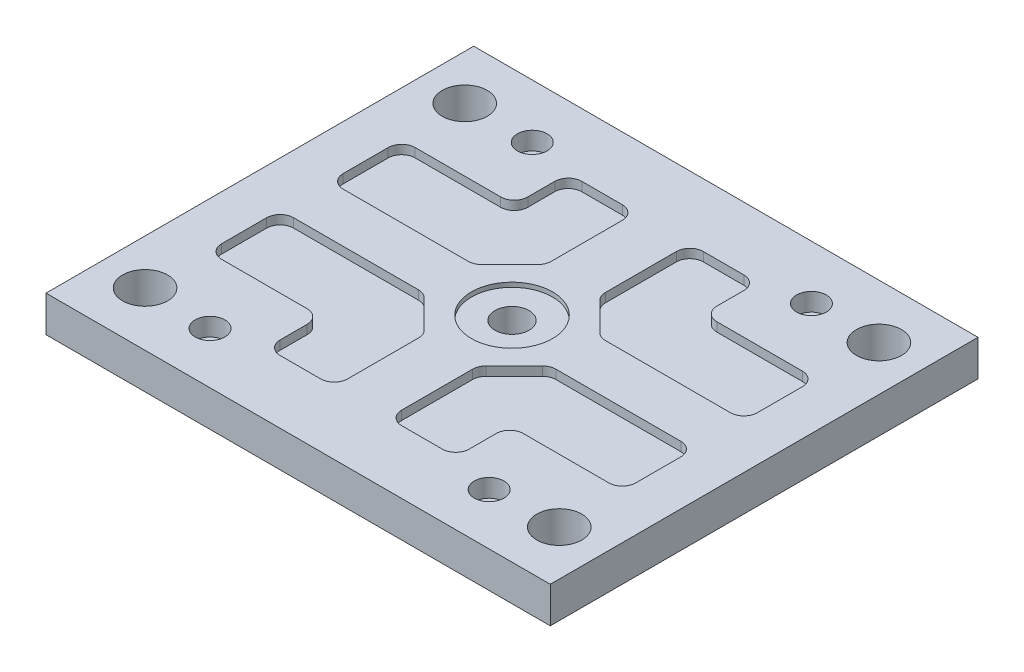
from build123d import *

# Parameters (mm, degrees)
SKETCH1_W                       = 560
SKETCH1_H                       = 475
BOSS_EXTRUDE1_DEPTH             = 40
SKETCH2_R                       = 25
CUT_EXTRUDE1_DEPTH              = 370.332167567
CBORE_FOR_M20_SHCS1_D           = 22
CBORE_FOR_M20_SHCS1_CBORE_D     = 33
CBORE_FOR_M20_SHCS1_CBORE_DEPTH = 20
SKETCH5_R                       = 45
CUT_EXTRUDE2_DEPTH              = 5
SKETCH6_R                       = 19
CUT_EXTRUDE3_DEPTH              = 369.824145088
CUT_EXTRUDE4_DEPTH              = 10
CUT_EXTRUDE5_START              = -10
CUT_EXTRUDE5_DEPTH              = 10


with BuildPart() as part:
    # Sketch1 → Boss-Extrude1 (new body)
    with BuildSketch(Plane(origin=(0, 0, 0), x_dir=(1, 0, 0), z_dir=(0, 1, 0))):
        Rectangle(SKETCH1_W, SKETCH1_H)
    extrude(amount=BOSS_EXTRUDE1_DEPTH)

    # Sketch2 → Cut-Extrude1 (cut, through all)
    with BuildSketch(Plane(origin=(0, 40, 0), x_dir=(1, 0, 0), z_dir=(0, 1, 0))):
        with Locations(Location((-230, 177.5, 0), (0, 0, 270))):
            Circle(SKETCH2_R)
        with Locations(Location((230, 177.5, 0), (0, 0, 270))):
            Circle(SKETCH2_R)
        with Locations(Location((-230, -177.5, 0), (0, 0, 270))):
            Circle(SKETCH2_R)
        with Locations(Location((230, -177.5, 0), (0, 0, 270))):
            Circle(SKETCH2_R)
    extrude(amount=-CUT_EXTRUDE1_DEPTH, mode=Mode.SUBTRACT)

    # CBORE for M20 SHCS1 (through all)
    with Locations(Plane(origin=(0, 40, 0), x_dir=(-1, 0, 0), z_dir=(0, 1, 0))):
        with Locations((155, -177.5), (-155, -177.5), (-155, 180.367334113), (155, 180.367334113)):
            CounterBoreHole(CBORE_FOR_M20_SHCS1_D / 2, CBORE_FOR_M20_SHCS1_CBORE_D / 2, CBORE_FOR_M20_SHCS1_CBORE_DEPTH)

    # Sketch5 → Cut-Extrude2 (cut)
    with BuildSketch(Plane(origin=(0, 40, 0), x_dir=(1, 0, 0), z_dir=(0, 1, 0))):
        with Locations(Location((0, 0, 0), (0, 0, 270))):
            Circle(SKETCH5_R)
    extrude(amount=-CUT_EXTRUDE2_DEPTH, mode=Mode.SUBTRACT)

    # Sketch6 → Cut-Extrude3 (cut, through all)
    with BuildSketch(Plane(origin=(0, 35, 0), x_dir=(1, 0, 0), z_dir=(0, 1, 0))):
        with Locations(Location((0, 0, 0), (0, 0, 270))):
            Circle(SKETCH6_R)
    extrude(amount=-CUT_EXTRUDE3_DEPTH, mode=Mode.SUBTRACT)

    # Sketch7 → Cut-Extrude4 (cut)
    with BuildSketch(Plane(origin=(0, 40, 0), x_dir=(1, 0, 0), z_dir=(0, 1, 0))):
        with BuildLine():
            Line((-30, -152.5), (-30, -73.713203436))
            ThreePointArc((-30, -73.713203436), (-31.141807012, -67.97295195), (-34.393398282, -63.106601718))
            Line((-34.393398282, -63.106601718), (-65.606601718, -31.893398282))
            ThreePointArc((-65.606601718, -31.893398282), (-70.47295195, -28.641807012), (-76.213203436, -27.5))
            Line((-76.213203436, -27.5), (-215, -27.5))
            ThreePointArc((-215, -27.5), (-225.606601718, -31.893398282), (-230, -42.5))
            Line((-230, -42.5), (-230, -92.5))
            ThreePointArc((-230, -92.5), (-225.606601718, -103.106601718), (-215, -107.5))
            Line((-215, -107.5), (-120, -107.5))
            ThreePointArc((-120, -107.5), (-109.393398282, -111.893398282), (-105, -122.5))
            Line((-105, -122.5), (-105, -152.5))
            ThreePointArc((-105, -152.5), (-100.606601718, -163.106601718), (-90, -167.5))
            Line((-90, -167.5), (-45, -167.5))
            ThreePointArc((-45, -167.5), (-34.393398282, -163.106601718), (-30, -152.5))
        make_face()
        with BuildLine():
            Line((-105, 122.5), (-105, 152.5))
            ThreePointArc((-105, 152.5), (-100.606601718, 163.106601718), (-90, 167.5))
            Line((-90, 167.5), (-45, 167.5))
            ThreePointArc((-45, 167.5), (-34.393398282, 163.106601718), (-30, 152.5))
            Line((-30, 152.5), (-30, 73.713203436))
            ThreePointArc((-30, 73.713203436), (-31.141807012, 67.97295195), (-34.393398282, 63.106601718))
            Line((-34.393398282, 63.106601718), (-65.606601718, 31.893398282))
            ThreePointArc((-65.606601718, 31.893398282), (-70.47295195, 28.641807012), (-76.213203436, 27.5))
            Line((-76.213203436, 27.5), (-215, 27.5))
            ThreePointArc((-215, 27.5), (-225.606601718, 31.893398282), (-230, 42.5))
            Line((-230, 42.5), (-230, 92.5))
            ThreePointArc((-230, 92.5), (-225.606601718, 103.106601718), (-215, 107.5))
            Line((-215, 107.5), (-120, 107.5))
            ThreePointArc((-120, 107.5), (-109.393398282, 111.893398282), (-105, 122.5))
        make_face()
        with BuildLine():
            Line((215, 107.5), (120, 107.5))
            ThreePointArc((120, 107.5), (109.393398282, 111.893398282), (105, 122.5))
            Line((105, 122.5), (105, 152.5))
            ThreePointArc((105, 152.5), (100.606601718, 163.106601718), (90, 167.5))
            Line((90, 167.5), (45, 167.5))
            ThreePointArc((45, 167.5), (34.393398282, 163.106601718), (30, 152.5))
            Line((30, 152.5), (30, 73.713203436))
            ThreePointArc((30, 73.713203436), (31.141807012, 67.97295195), (34.393398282, 63.106601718))
            Line((34.393398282, 63.106601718), (65.606601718, 31.893398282))
            ThreePointArc((65.606601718, 31.893398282), (70.47295195, 28.641807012), (76.213203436, 27.5))
            Line((76.213203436, 27.5), (215, 27.5))
            ThreePointArc((215, 27.5), (225.606601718, 31.893398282), (230, 42.5))
            Line((230, 42.5), (230, 92.5))
            ThreePointArc((230, 92.5), (225.606601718, 103.106601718), (215, 107.5))
        make_face()
        with BuildLine():
            Line((105, -122.5), (105, -152.5))
            ThreePointArc((105, -152.5), (100.606601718, -163.106601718), (90, -167.5))
            Line((90, -167.5), (45, -167.5))
            ThreePointArc((45, -167.5), (34.393398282, -163.106601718), (30, -152.5))
            Line((30, -152.5), (30, -73.713203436))
            ThreePointArc((30, -73.713203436), (31.141807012, -67.97295195), (34.393398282, -63.106601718))
            Line((34.393398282, -63.106601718), (65.606601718, -31.893398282))
            ThreePointArc((65.606601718, -31.893398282), (70.47295195, -28.641807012), (76.213203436, -27.5))
            Line((76.213203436, -27.5), (215, -27.5))
            ThreePointArc((215, -27.5), (225.606601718, -31.893398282), (230, -42.5))
            Line((230, -42.5), (230, -92.5))
            ThreePointArc((230, -92.5), (225.606601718, -103.106601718), (215, -107.5))
            Line((215, -107.5), (120, -107.5))
            ThreePointArc((120, -107.5), (109.393398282, -111.893398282), (105, -122.5))
        make_face()
    extrude(amount=-CUT_EXTRUDE4_DEPTH, mode=Mode.SUBTRACT)

    # Sketch8 → Cut-Extrude5 (cut)
    with BuildSketch(Plane.XZ.offset(CUT_EXTRUDE5_START)):
        with BuildLine():
            Line((-30, -152.5), (-30, -73.713203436))
            ThreePointArc((-30, -73.713203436), (-31.141807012, -67.97295195), (-34.393398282, -63.106601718))
            Line((-34.393398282, -63.106601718), (-65.606601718, -31.893398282))
            ThreePointArc((-65.606601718, -31.893398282), (-70.47295195, -28.641807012), (-76.213203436, -27.5))
            Line((-76.213203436, -27.5), (-215, -27.5))
            ThreePointArc((-215, -27.5), (-225.606601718, -31.893398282), (-230, -42.5))
            Line((-230, -42.5), (-230, -92.5))
            ThreePointArc((-230, -92.5), (-225.606601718, -103.106601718), (-215, -107.5))
            Line((-215, -107.5), (-120, -107.5))
            ThreePointArc((-120, -107.5), (-109.393398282, -111.893398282), (-105, -122.5))
            Line((-105, -122.5), (-105, -152.5))
            ThreePointArc((-105, -152.5), (-100.606601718, -163.106601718), (-90, -167.5))
            Line((-90, -167.5), (-45, -167.5))
            ThreePointArc((-45, -167.5), (-34.393398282, -163.106601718), (-30, -152.5))
        make_face()
        with BuildLine():
            Line((-105, 122.5), (-105, 152.5))
            ThreePointArc((-105, 152.5), (-100.606601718, 163.106601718), (-90, 167.5))
            Line((-90, 167.5), (-45, 167.5))
            ThreePointArc((-45, 167.5), (-34.393398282, 163.106601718), (-30, 152.5))
            Line((-30, 152.5), (-30, 73.713203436))
            ThreePointArc((-30, 73.713203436), (-31.141807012, 67.97295195), (-34.393398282, 63.106601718))
            Line((-34.393398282, 63.106601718), (-65.606601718, 31.893398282))
            ThreePointArc((-65.606601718, 31.893398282), (-70.47295195, 28.641807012), (-76.213203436, 27.5))
            Line((-76.213203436, 27.5), (-215, 27.5))
            ThreePointArc((-215, 27.5), (-225.606601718, 31.893398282), (-230, 42.5))
            Line((-230, 42.5), (-230, 92.5))
            ThreePointArc((-230, 92.5), (-225.606601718, 103.106601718), (-215, 107.5))
            Line((-215, 107.5), (-120, 107.5))
            ThreePointArc((-120, 107.5), (-109.393398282, 111.893398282), (-105, 122.5))
        make_face()
        with BuildLine():
            Line((215, 107.5), (120, 107.5))
            ThreePointArc((120, 107.5), (109.393398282, 111.893398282), (105, 122.5))
            Line((105, 122.5), (105, 152.5))
            ThreePointArc((105, 152.5), (100.606601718, 163.106601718), (90, 167.5))
            Line((90, 167.5), (45, 167.5))
            ThreePointArc((45, 167.5), (34.393398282, 163.106601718), (30, 152.5))
            Line((30, 152.5), (30, 73.713203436))
            ThreePointArc((30, 73.713203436), (31.141807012, 67.97295195), (34.393398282, 63.106601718))
            Line((34.393398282, 63.106601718), (65.606601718, 31.893398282))
            ThreePointArc((65.606601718, 31.893398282), (70.47295195, 28.641807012), (76.213203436, 27.5))
            Line((76.213203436, 27.5), (215, 27.5))
            ThreePointArc((215, 27.5), (225.606601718, 31.893398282), (230, 42.5))
            Line((230, 42.5), (230, 92.5))
            ThreePointArc((230, 92.5), (225.606601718, 103.106601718), (215, 107.5))
        make_face()
        with BuildLine():
            Line((105, -122.5), (105, -152.5))
            ThreePointArc((105, -152.5), (100.606601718, -163.106601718), (90, -167.5))
            Line((90, -167.5), (45, -167.5))
            ThreePointArc((45, -167.5), (34.393398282, -163.106601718), (30, -152.5))
            Line((30, -152.5), (30, -73.713203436))
            ThreePointArc((30, -73.713203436), (31.141807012, -67.97295195), (34.393398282, -63.106601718))
            Line((34.393398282, -63.106601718), (65.606601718, -31.893398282))
            ThreePointArc((65.606601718, -31.893398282), (70.47295195, -28.641807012), (76.213203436, -27.5))
            Line((76.213203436, -27.5), (215, -27.5))
            ThreePointArc((215, -27.5), (225.606601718, -31.893398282), (230, -42.5))
            Line((230, -42.5), (230, -92.5))
            ThreePointArc((230, -92.5), (225.606601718, -103.106601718), (215, -107.5))
            Line((215, -107.5), (120, -107.5))
            ThreePointArc((120, -107.5), (109.393398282, -111.893398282), (105, -122.5))
        make_face()
    extrude(amount=CUT_EXTRUDE5_DEPTH, mode=Mode.SUBTRACT)


solid = part.part
